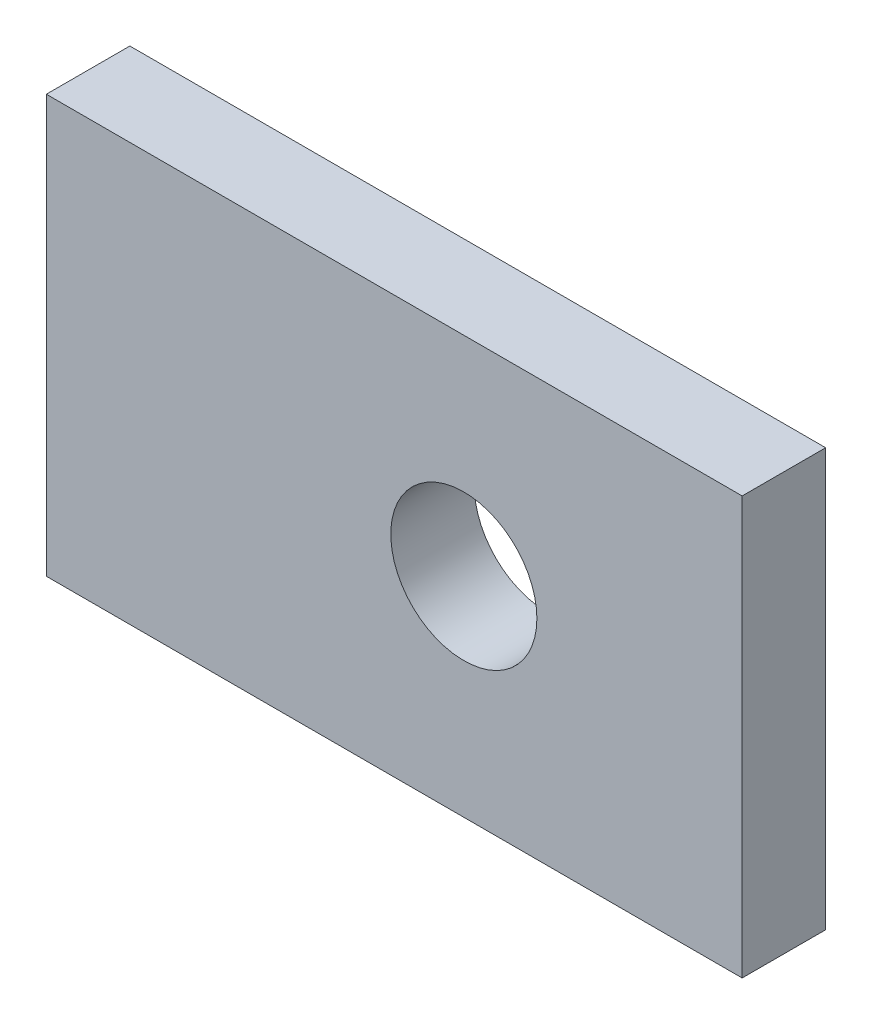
from build123d import *

# Parameters (mm, degrees)
ESQUISSE1_W          = 100
ESQUISSE1_H          = 60
ESQUISSE1_R          = 10.5
BASE_EXTRUSION_DEPTH = 12
EXTRUSION1_DEPTH     = 20
CHANFREIN1_SIZE      = 6


with BuildPart() as part:
    # Esquisse1 → Base-Extrusion (new body)
    with BuildSketch(Plane.XY):
        with Locations((50, 30)):
            Rectangle(ESQUISSE1_W, ESQUISSE1_H)
        with Locations((60, 30)):
            Circle(ESQUISSE1_R, mode=Mode.SUBTRACT)
    extrude(amount=BASE_EXTRUSION_DEPTH)

    # Esquisse2 → Extrusion1 (add)
    with BuildSketch(Plane.ZY):
        with BuildLine():
            Line((0, 37.5), (-5.733333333, 33.2))
            ThreePointArc((-5.733333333, 33.2), (-7.333333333, 30), (-5.733333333, 26.8))
            Line((-5.733333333, 26.8), (0, 22.5))
            Line((0, 22.5), (0, 37.5))
        make_face()
    extrude(amount=-EXTRUSION1_DEPTH)

    # Chanfrein1
    chanfrein1_edges = [part.edges().sort_by_distance(p)[0] for p in [
        (20, 30, 0),
    ]]
    chamfer(chanfrein1_edges, length=CHANFREIN1_SIZE)


solid = part.part
